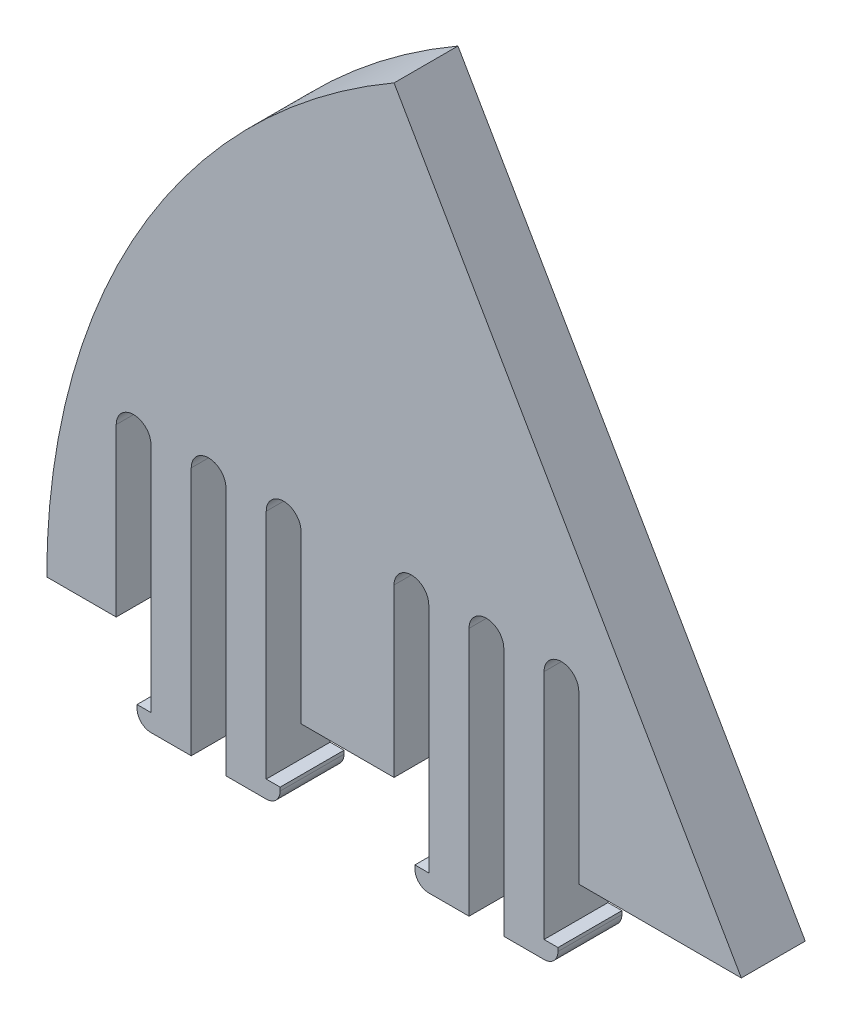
ISO-10303-21;
HEADER;
FILE_DESCRIPTION(('STEP AP214'),'2;1');
FILE_NAME('part.step','',(''),(''),'','','');
FILE_SCHEMA(('AUTOMOTIVE_DESIGN { 1 0 10303 214 1 1 1 1 }'));
ENDSEC;
DATA;
#1=APPLICATION_CONTEXT('core data for automotive mechanical design processes');
#2=APPLICATION_PROTOCOL_DEFINITION('international standard','automotive_design',2000,#1);
#3=PRODUCT_CONTEXT('',#1,'mechanical');
#4=PRODUCT('Part','Part','',(#3));
#5=PRODUCT_RELATED_PRODUCT_CATEGORY('part','',(#4));
#6=PRODUCT_DEFINITION_FORMATION('','',#4);
#7=PRODUCT_DEFINITION_CONTEXT('part definition',#1,'design');
#8=PRODUCT_DEFINITION('design','',#6,#7);
#9=PRODUCT_DEFINITION_SHAPE('','',#8);
#10=(LENGTH_UNIT() NAMED_UNIT(*) SI_UNIT(.MILLI.,.METRE.));
#11=(NAMED_UNIT(*) PLANE_ANGLE_UNIT() SI_UNIT($,.RADIAN.));
#12=(NAMED_UNIT(*) SI_UNIT($,.STERADIAN.) SOLID_ANGLE_UNIT());
#13=UNCERTAINTY_MEASURE_WITH_UNIT(LENGTH_MEASURE(1.E-05),#10,'distance_accuracy_value','');
#14=(GEOMETRIC_REPRESENTATION_CONTEXT(3) GLOBAL_UNCERTAINTY_ASSIGNED_CONTEXT((#13)) GLOBAL_UNIT_ASSIGNED_CONTEXT((#10,
#11,#12)) REPRESENTATION_CONTEXT('',''));
#15=CARTESIAN_POINT('',(0.,0.,0.));
#16=DIRECTION('',(0.,0.,1.));
#17=DIRECTION('',(1.,0.,0.));
#18=AXIS2_PLACEMENT_3D('',#15,#16,#17);
#19=CARTESIAN_POINT('',(0.,0.,5.842));
#20=DIRECTION('',(-0.86602540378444,-0.499999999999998,0.));
#21=DIRECTION('',(0.499999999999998,-0.86602540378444,0.));
#22=AXIS2_PLACEMENT_3D('',#19,#20,#21);
#23=PLANE('',#22);
#24=DIRECTION('',(-0.499999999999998,0.86602540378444,0.));
#25=VECTOR('',#24,1.);
#26=CARTESIAN_POINT('',(0.,0.,0.));
#27=LINE('',#26,#25);
#28=CARTESIAN_POINT('',(0.,0.,0.));
#29=VERTEX_POINT('',#28);
#30=CARTESIAN_POINT('',(-31.7499999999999,54.9926131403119,0.));
#31=VERTEX_POINT('',#30);
#32=EDGE_CURVE('E617',#29,#31,#27,.T.);
#33=ORIENTED_EDGE('',*,*,#32,.T.);
#34=DIRECTION('',(0.,0.,-1.));
#35=VECTOR('',#34,1.);
#36=CARTESIAN_POINT('',(-31.7499999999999,54.9926131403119,5.842));
#37=LINE('',#36,#35);
#38=CARTESIAN_POINT('',(-31.7499999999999,54.9926131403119,5.842));
#39=VERTEX_POINT('',#38);
#40=EDGE_CURVE('E12',#39,#31,#37,.T.);
#41=ORIENTED_EDGE('',*,*,#40,.F.);
#42=DIRECTION('',(-0.499999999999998,0.86602540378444,0.));
#43=VECTOR('',#42,1.);
#44=CARTESIAN_POINT('',(0.,0.,5.842));
#45=LINE('',#44,#43);
#46=CARTESIAN_POINT('',(0.,0.,5.842));
#47=VERTEX_POINT('',#46);
#48=EDGE_CURVE('E489',#47,#39,#45,.T.);
#49=ORIENTED_EDGE('',*,*,#48,.F.);
#50=DIRECTION('',(0.,0.,-1.));
#51=VECTOR('',#50,1.);
#52=CARTESIAN_POINT('',(0.,0.,5.842));
#53=LINE('',#52,#51);
#54=EDGE_CURVE('E317',#47,#29,#53,.T.);
#55=ORIENTED_EDGE('',*,*,#54,.T.);
#56=EDGE_LOOP('',(#33,#41,#49,#55));
#57=FACE_BOUND('',#56,.T.);
#58=ADVANCED_FACE('F36',(#57),#23,.F.);
#59=CARTESIAN_POINT('',(0.,0.,5.842));
#60=DIRECTION('',(0.,0.,-1.));
#61=DIRECTION('',(-1.,0.,0.));
#62=AXIS2_PLACEMENT_3D('',#59,#60,#61);
#63=CYLINDRICAL_SURFACE('',#62,63.5);
#64=CARTESIAN_POINT('',(0.,0.,0.));
#65=DIRECTION('',(0.,0.,1.));
#66=DIRECTION('',(1.,0.,0.));
#67=AXIS2_PLACEMENT_3D('',#64,#65,#66);
#68=CIRCLE('',#67,63.5);
#69=CARTESIAN_POINT('',(-63.5,0.,0.));
#70=VERTEX_POINT('',#69);
#71=EDGE_CURVE('E611',#31,#70,#68,.T.);
#72=ORIENTED_EDGE('',*,*,#71,.T.);
#73=DIRECTION('',(0.,0.,-1.));
#74=VECTOR('',#73,1.);
#75=CARTESIAN_POINT('',(-63.5,0.,5.842));
#76=LINE('',#75,#74);
#77=CARTESIAN_POINT('',(-63.5,0.,5.842));
#78=VERTEX_POINT('',#77);
#79=EDGE_CURVE('E44',#78,#70,#76,.T.);
#80=ORIENTED_EDGE('',*,*,#79,.F.);
#81=CARTESIAN_POINT('',(0.,0.,5.842));
#82=DIRECTION('',(0.,0.,1.));
#83=DIRECTION('',(1.,0.,0.));
#84=AXIS2_PLACEMENT_3D('',#81,#82,#83);
#85=CIRCLE('',#84,63.5);
#86=EDGE_CURVE('E188',#39,#78,#85,.T.);
#87=ORIENTED_EDGE('',*,*,#86,.F.);
#88=ORIENTED_EDGE('',*,*,#40,.T.);
#89=EDGE_LOOP('',(#72,#80,#87,#88));
#90=FACE_BOUND('',#89,.T.);
#91=ADVANCED_FACE('F700',(#90),#63,.T.);
#92=CARTESIAN_POINT('',(-57.15,0.,5.842));
#93=DIRECTION('',(0.,1.,0.));
#94=DIRECTION('',(-1.,0.,0.));
#95=AXIS2_PLACEMENT_3D('',#92,#93,#94);
#96=PLANE('',#95);
#97=DIRECTION('',(1.,0.,0.));
#98=VECTOR('',#97,1.);
#99=CARTESIAN_POINT('',(-57.15,0.,0.));
#100=LINE('',#99,#98);
#101=CARTESIAN_POINT('',(-57.15,0.,0.));
#102=VERTEX_POINT('',#101);
#103=EDGE_CURVE('E606',#70,#102,#100,.T.);
#104=ORIENTED_EDGE('',*,*,#103,.T.);
#105=DIRECTION('',(0.,0.,-1.));
#106=VECTOR('',#105,1.);
#107=CARTESIAN_POINT('',(-57.15,0.,5.842));
#108=LINE('',#107,#106);
#109=CARTESIAN_POINT('',(-57.15,0.,5.842));
#110=VERTEX_POINT('',#109);
#111=EDGE_CURVE('E598',#110,#102,#108,.T.);
#112=ORIENTED_EDGE('',*,*,#111,.F.);
#113=DIRECTION('',(1.,0.,0.));
#114=VECTOR('',#113,1.);
#115=CARTESIAN_POINT('',(-57.15,0.,5.842));
#116=LINE('',#115,#114);
#117=EDGE_CURVE('E482',#78,#110,#116,.T.);
#118=ORIENTED_EDGE('',*,*,#117,.F.);
#119=ORIENTED_EDGE('',*,*,#79,.T.);
#120=EDGE_LOOP('',(#104,#112,#118,#119));
#121=FACE_BOUND('',#120,.T.);
#122=ADVANCED_FACE('F604',(#121),#96,.F.);
#123=CARTESIAN_POINT('',(-57.15,0.,5.842));
#124=DIRECTION('',(-1.,0.,0.));
#125=DIRECTION('',(0.,0.,1.));
#126=AXIS2_PLACEMENT_3D('',#123,#124,#125);
#127=PLANE('',#126);
#128=DIRECTION('',(0.,1.,0.));
#129=VECTOR('',#128,1.);
#130=CARTESIAN_POINT('',(-57.15,0.,0.));
#131=LINE('',#130,#129);
#132=CARTESIAN_POINT('',(-57.15,15.24,0.));
#133=VERTEX_POINT('',#132);
#134=EDGE_CURVE('E613',#102,#133,#131,.T.);
#135=ORIENTED_EDGE('',*,*,#134,.T.);
#136=DIRECTION('',(0.,0.,-1.));
#137=VECTOR('',#136,1.);
#138=CARTESIAN_POINT('',(-57.15,15.24,5.842));
#139=LINE('',#138,#137);
#140=CARTESIAN_POINT('',(-57.15,15.24,5.842));
#141=VERTEX_POINT('',#140);
#142=EDGE_CURVE('E595',#141,#133,#139,.T.);
#143=ORIENTED_EDGE('',*,*,#142,.F.);
#144=DIRECTION('',(0.,1.,0.));
#145=VECTOR('',#144,1.);
#146=CARTESIAN_POINT('',(-57.15,0.,5.842));
#147=LINE('',#146,#145);
#148=EDGE_CURVE('E479',#110,#141,#147,.T.);
#149=ORIENTED_EDGE('',*,*,#148,.F.);
#150=ORIENTED_EDGE('',*,*,#111,.T.);
#151=EDGE_LOOP('',(#135,#143,#149,#150));
#152=FACE_BOUND('',#151,.T.);
#153=ADVANCED_FACE('F707',(#152),#127,.F.);
#154=CARTESIAN_POINT('',(-55.5625,15.24,5.842));
#155=DIRECTION('',(0.,0.,-1.));
#156=DIRECTION('',(-1.,0.,0.));
#157=AXIS2_PLACEMENT_3D('',#154,#155,#156);
#158=CYLINDRICAL_SURFACE('',#157,1.5875);
#159=CARTESIAN_POINT('',(-55.5625,15.24,0.));
#160=DIRECTION('',(0.,0.,-1.));
#161=DIRECTION('',(1.,0.,0.));
#162=AXIS2_PLACEMENT_3D('',#159,#160,#161);
#163=CIRCLE('',#162,1.5875);
#164=CARTESIAN_POINT('',(-53.975,15.24,0.));
#165=VERTEX_POINT('',#164);
#166=EDGE_CURVE('E615',#133,#165,#163,.T.);
#167=ORIENTED_EDGE('',*,*,#166,.T.);
#168=DIRECTION('',(0.,0.,-1.));
#169=VECTOR('',#168,1.);
#170=CARTESIAN_POINT('',(-53.975,15.24,5.842));
#171=LINE('',#170,#169);
#172=CARTESIAN_POINT('',(-53.975,15.24,5.842));
#173=VERTEX_POINT('',#172);
#174=EDGE_CURVE('E592',#173,#165,#171,.T.);
#175=ORIENTED_EDGE('',*,*,#174,.F.);
#176=CARTESIAN_POINT('',(-55.5625,15.24,5.842));
#177=DIRECTION('',(0.,0.,-1.));
#178=DIRECTION('',(1.,0.,0.));
#179=AXIS2_PLACEMENT_3D('',#176,#177,#178);
#180=CIRCLE('',#179,1.5875);
#181=EDGE_CURVE('E471',#141,#173,#180,.T.);
#182=ORIENTED_EDGE('',*,*,#181,.F.);
#183=ORIENTED_EDGE('',*,*,#142,.T.);
#184=EDGE_LOOP('',(#167,#175,#182,#183));
#185=FACE_BOUND('',#184,.T.);
#186=ADVANCED_FACE('F712',(#185),#158,.F.);
#187=CARTESIAN_POINT('',(-53.975,-5.96900000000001,5.842));
#188=DIRECTION('',(1.,0.,0.));
#189=DIRECTION('',(0.,1.,0.));
#190=AXIS2_PLACEMENT_3D('',#187,#188,#189);
#191=PLANE('',#190);
#192=DIRECTION('',(0.,-1.,0.));
#193=VECTOR('',#192,1.);
#194=CARTESIAN_POINT('',(-53.975,-5.96900000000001,0.));
#195=LINE('',#194,#193);
#196=CARTESIAN_POINT('',(-53.975,-5.96900000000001,0.));
#197=VERTEX_POINT('',#196);
#198=EDGE_CURVE('E621',#165,#197,#195,.T.);
#199=ORIENTED_EDGE('',*,*,#198,.T.);
#200=DIRECTION('',(0.,0.,-1.));
#201=VECTOR('',#200,1.);
#202=CARTESIAN_POINT('',(-53.975,-5.96900000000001,5.842));
#203=LINE('',#202,#201);
#204=CARTESIAN_POINT('',(-53.975,-5.96900000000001,5.842));
#205=VERTEX_POINT('',#204);
#206=EDGE_CURVE('E589',#205,#197,#203,.T.);
#207=ORIENTED_EDGE('',*,*,#206,.F.);
#208=DIRECTION('',(0.,-1.,0.));
#209=VECTOR('',#208,1.);
#210=CARTESIAN_POINT('',(-53.975,-5.96900000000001,5.842));
#211=LINE('',#210,#209);
#212=EDGE_CURVE('E467',#173,#205,#211,.T.);
#213=ORIENTED_EDGE('',*,*,#212,.F.);
#214=ORIENTED_EDGE('',*,*,#174,.T.);
#215=EDGE_LOOP('',(#199,#207,#213,#214));
#216=FACE_BOUND('',#215,.T.);
#217=ADVANCED_FACE('F716',(#216),#191,.F.);
#218=CARTESIAN_POINT('',(-55.245,-5.96900000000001,5.842));
#219=DIRECTION('',(0.,-1.,0.));
#220=DIRECTION('',(1.,0.,0.));
#221=AXIS2_PLACEMENT_3D('',#218,#219,#220);
#222=PLANE('',#221);
#223=DIRECTION('',(-1.,0.,0.));
#224=VECTOR('',#223,1.);
#225=CARTESIAN_POINT('',(-55.245,-5.96900000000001,0.));
#226=LINE('',#225,#224);
#227=CARTESIAN_POINT('',(-55.245,-5.96900000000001,0.));
#228=VERTEX_POINT('',#227);
#229=EDGE_CURVE('E623',#197,#228,#226,.T.);
#230=ORIENTED_EDGE('',*,*,#229,.T.);
#231=DIRECTION('',(0.,0.,-1.));
#232=VECTOR('',#231,1.);
#233=CARTESIAN_POINT('',(-55.245,-5.96900000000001,5.842));
#234=LINE('',#233,#232);
#235=CARTESIAN_POINT('',(-55.245,-5.96900000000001,5.842));
#236=VERTEX_POINT('',#235);
#237=EDGE_CURVE('E586',#236,#228,#234,.T.);
#238=ORIENTED_EDGE('',*,*,#237,.F.);
#239=DIRECTION('',(-1.,0.,0.));
#240=VECTOR('',#239,1.);
#241=CARTESIAN_POINT('',(-55.245,-5.96900000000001,5.842));
#242=LINE('',#241,#240);
#243=EDGE_CURVE('E463',#205,#236,#242,.T.);
#244=ORIENTED_EDGE('',*,*,#243,.F.);
#245=ORIENTED_EDGE('',*,*,#206,.T.);
#246=EDGE_LOOP('',(#230,#238,#244,#245));
#247=FACE_BOUND('',#246,.T.);
#248=ADVANCED_FACE('F720',(#247),#222,.F.);
#249=CARTESIAN_POINT('',(-55.245,-6.28650000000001,5.842));
#250=DIRECTION('',(1.,0.,0.));
#251=DIRECTION('',(0.,0.,-1.));
#252=AXIS2_PLACEMENT_3D('',#249,#250,#251);
#253=PLANE('',#252);
#254=DIRECTION('',(0.,-1.,0.));
#255=VECTOR('',#254,1.);
#256=CARTESIAN_POINT('',(-55.245,-6.28650000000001,0.));
#257=LINE('',#256,#255);
#258=CARTESIAN_POINT('',(-55.245,-6.28650000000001,0.));
#259=VERTEX_POINT('',#258);
#260=EDGE_CURVE('E625',#228,#259,#257,.T.);
#261=ORIENTED_EDGE('',*,*,#260,.T.);
#262=DIRECTION('',(0.,0.,-1.));
#263=VECTOR('',#262,1.);
#264=CARTESIAN_POINT('',(-55.245,-6.28650000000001,5.842));
#265=LINE('',#264,#263);
#266=CARTESIAN_POINT('',(-55.245,-6.28650000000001,5.842));
#267=VERTEX_POINT('',#266);
#268=EDGE_CURVE('E583',#267,#259,#265,.T.);
#269=ORIENTED_EDGE('',*,*,#268,.F.);
#270=DIRECTION('',(0.,-1.,0.));
#271=VECTOR('',#270,1.);
#272=CARTESIAN_POINT('',(-55.245,-6.28650000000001,5.842));
#273=LINE('',#272,#271);
#274=EDGE_CURVE('E460',#236,#267,#273,.T.);
#275=ORIENTED_EDGE('',*,*,#274,.F.);
#276=ORIENTED_EDGE('',*,*,#237,.T.);
#277=EDGE_LOOP('',(#261,#269,#275,#276));
#278=FACE_BOUND('',#277,.T.);
#279=ADVANCED_FACE('F724',(#278),#253,.F.);
#280=CARTESIAN_POINT('',(-53.975,-6.28650000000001,5.842));
#281=DIRECTION('',(0.,0.,-1.));
#282=DIRECTION('',(-1.,0.,0.));
#283=AXIS2_PLACEMENT_3D('',#280,#281,#282);
#284=CYLINDRICAL_SURFACE('',#283,1.27);
#285=CARTESIAN_POINT('',(-53.975,-6.28650000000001,0.));
#286=DIRECTION('',(0.,0.,1.));
#287=DIRECTION('',(1.,0.,0.));
#288=AXIS2_PLACEMENT_3D('',#285,#286,#287);
#289=CIRCLE('',#288,1.27);
#290=CARTESIAN_POINT('',(-53.975,-7.55650000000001,0.));
#291=VERTEX_POINT('',#290);
#292=EDGE_CURVE('E627',#259,#291,#289,.T.);
#293=ORIENTED_EDGE('',*,*,#292,.T.);
#294=DIRECTION('',(0.,0.,-1.));
#295=VECTOR('',#294,1.);
#296=CARTESIAN_POINT('',(-53.975,-7.55650000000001,5.842));
#297=LINE('',#296,#295);
#298=CARTESIAN_POINT('',(-53.975,-7.55650000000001,5.842));
#299=VERTEX_POINT('',#298);
#300=EDGE_CURVE('E580',#299,#291,#297,.T.);
#301=ORIENTED_EDGE('',*,*,#300,.F.);
#302=CARTESIAN_POINT('',(-53.975,-6.28650000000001,5.842));
#303=DIRECTION('',(0.,0.,1.));
#304=DIRECTION('',(1.,0.,0.));
#305=AXIS2_PLACEMENT_3D('',#302,#303,#304);
#306=CIRCLE('',#305,1.27);
#307=EDGE_CURVE('E452',#267,#299,#306,.T.);
#308=ORIENTED_EDGE('',*,*,#307,.F.);
#309=ORIENTED_EDGE('',*,*,#268,.T.);
#310=EDGE_LOOP('',(#293,#301,#308,#309));
#311=FACE_BOUND('',#310,.T.);
#312=ADVANCED_FACE('F728',(#311),#284,.T.);
#313=CARTESIAN_POINT('',(-50.292,-7.55650000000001,5.842));
#314=DIRECTION('',(0.,1.,0.));
#315=DIRECTION('',(0.,0.,1.));
#316=AXIS2_PLACEMENT_3D('',#313,#314,#315);
#317=PLANE('',#316);
#318=DIRECTION('',(1.,0.,0.));
#319=VECTOR('',#318,1.);
#320=CARTESIAN_POINT('',(-50.292,-7.55650000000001,0.));
#321=LINE('',#320,#319);
#322=CARTESIAN_POINT('',(-50.292,-7.55650000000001,0.));
#323=VERTEX_POINT('',#322);
#324=EDGE_CURVE('E629',#291,#323,#321,.T.);
#325=ORIENTED_EDGE('',*,*,#324,.T.);
#326=DIRECTION('',(0.,0.,-1.));
#327=VECTOR('',#326,1.);
#328=CARTESIAN_POINT('',(-50.292,-7.55650000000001,5.842));
#329=LINE('',#328,#327);
#330=CARTESIAN_POINT('',(-50.292,-7.55650000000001,5.842));
#331=VERTEX_POINT('',#330);
#332=EDGE_CURVE('E577',#331,#323,#329,.T.);
#333=ORIENTED_EDGE('',*,*,#332,.F.);
#334=DIRECTION('',(1.,0.,0.));
#335=VECTOR('',#334,1.);
#336=CARTESIAN_POINT('',(-50.292,-7.55650000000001,5.842));
#337=LINE('',#336,#335);
#338=EDGE_CURVE('E448',#299,#331,#337,.T.);
#339=ORIENTED_EDGE('',*,*,#338,.F.);
#340=ORIENTED_EDGE('',*,*,#300,.T.);
#341=EDGE_LOOP('',(#325,#333,#339,#340));
#342=FACE_BOUND('',#341,.T.);
#343=ADVANCED_FACE('F732',(#342),#317,.F.);
#344=CARTESIAN_POINT('',(-50.292,-7.55650000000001,5.842));
#345=DIRECTION('',(-1.,0.,0.));
#346=DIRECTION('',(0.,-1.,0.));
#347=AXIS2_PLACEMENT_3D('',#344,#345,#346);
#348=PLANE('',#347);
#349=DIRECTION('',(0.,1.,0.));
#350=VECTOR('',#349,1.);
#351=CARTESIAN_POINT('',(-50.292,-7.55650000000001,0.));
#352=LINE('',#351,#350);
#353=CARTESIAN_POINT('',(-50.292,15.24,0.));
#354=VERTEX_POINT('',#353);
#355=EDGE_CURVE('E631',#323,#354,#352,.T.);
#356=ORIENTED_EDGE('',*,*,#355,.T.);
#357=DIRECTION('',(0.,0.,-1.));
#358=VECTOR('',#357,1.);
#359=CARTESIAN_POINT('',(-50.292,15.24,5.842));
#360=LINE('',#359,#358);
#361=CARTESIAN_POINT('',(-50.292,15.24,5.842));
#362=VERTEX_POINT('',#361);
#363=EDGE_CURVE('E574',#362,#354,#360,.T.);
#364=ORIENTED_EDGE('',*,*,#363,.F.);
#365=DIRECTION('',(0.,1.,0.));
#366=VECTOR('',#365,1.);
#367=CARTESIAN_POINT('',(-50.292,-7.55650000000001,5.842));
#368=LINE('',#367,#366);
#369=EDGE_CURVE('E444',#331,#362,#368,.T.);
#370=ORIENTED_EDGE('',*,*,#369,.F.);
#371=ORIENTED_EDGE('',*,*,#332,.T.);
#372=EDGE_LOOP('',(#356,#364,#370,#371));
#373=FACE_BOUND('',#372,.T.);
#374=ADVANCED_FACE('F736',(#373),#348,.F.);
#375=CARTESIAN_POINT('',(-48.7045,15.24,5.842));
#376=DIRECTION('',(0.,0.,-1.));
#377=DIRECTION('',(-1.,0.,0.));
#378=AXIS2_PLACEMENT_3D('',#375,#376,#377);
#379=CYLINDRICAL_SURFACE('',#378,1.5875);
#380=CARTESIAN_POINT('',(-48.7045,15.24,0.));
#381=DIRECTION('',(0.,0.,-1.));
#382=DIRECTION('',(1.,0.,0.));
#383=AXIS2_PLACEMENT_3D('',#380,#381,#382);
#384=CIRCLE('',#383,1.5875);
#385=CARTESIAN_POINT('',(-47.117,15.24,0.));
#386=VERTEX_POINT('',#385);
#387=EDGE_CURVE('E633',#354,#386,#384,.T.);
#388=ORIENTED_EDGE('',*,*,#387,.T.);
#389=DIRECTION('',(0.,0.,-1.));
#390=VECTOR('',#389,1.);
#391=CARTESIAN_POINT('',(-47.117,15.24,5.842));
#392=LINE('',#391,#390);
#393=CARTESIAN_POINT('',(-47.117,15.24,5.842));
#394=VERTEX_POINT('',#393);
#395=EDGE_CURVE('E571',#394,#386,#392,.T.);
#396=ORIENTED_EDGE('',*,*,#395,.F.);
#397=CARTESIAN_POINT('',(-48.7045,15.24,5.842));
#398=DIRECTION('',(0.,0.,-1.));
#399=DIRECTION('',(1.,0.,0.));
#400=AXIS2_PLACEMENT_3D('',#397,#398,#399);
#401=CIRCLE('',#400,1.5875);
#402=EDGE_CURVE('E441',#362,#394,#401,.T.);
#403=ORIENTED_EDGE('',*,*,#402,.F.);
#404=ORIENTED_EDGE('',*,*,#363,.T.);
#405=EDGE_LOOP('',(#388,#396,#403,#404));
#406=FACE_BOUND('',#405,.T.);
#407=ADVANCED_FACE('F740',(#406),#379,.F.);
#408=CARTESIAN_POINT('',(-47.117,-7.55650000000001,5.842));
#409=DIRECTION('',(1.,0.,0.));
#410=DIRECTION('',(0.,1.,0.));
#411=AXIS2_PLACEMENT_3D('',#408,#409,#410);
#412=PLANE('',#411);
#413=DIRECTION('',(0.,-1.,0.));
#414=VECTOR('',#413,1.);
#415=CARTESIAN_POINT('',(-47.117,-7.55650000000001,0.));
#416=LINE('',#415,#414);
#417=CARTESIAN_POINT('',(-47.117,-7.55650000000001,0.));
#418=VERTEX_POINT('',#417);
#419=EDGE_CURVE('E635',#386,#418,#416,.T.);
#420=ORIENTED_EDGE('',*,*,#419,.T.);
#421=DIRECTION('',(0.,0.,-1.));
#422=VECTOR('',#421,1.);
#423=CARTESIAN_POINT('',(-47.117,-7.55650000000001,5.842));
#424=LINE('',#423,#422);
#425=CARTESIAN_POINT('',(-47.117,-7.55650000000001,5.842));
#426=VERTEX_POINT('',#425);
#427=EDGE_CURVE('E568',#426,#418,#424,.T.);
#428=ORIENTED_EDGE('',*,*,#427,.F.);
#429=DIRECTION('',(0.,-1.,0.));
#430=VECTOR('',#429,1.);
#431=CARTESIAN_POINT('',(-47.117,-7.55650000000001,5.842));
#432=LINE('',#431,#430);
#433=EDGE_CURVE('E433',#394,#426,#432,.T.);
#434=ORIENTED_EDGE('',*,*,#433,.F.);
#435=ORIENTED_EDGE('',*,*,#395,.T.);
#436=EDGE_LOOP('',(#420,#428,#434,#435));
#437=FACE_BOUND('',#436,.T.);
#438=ADVANCED_FACE('F744',(#437),#412,.F.);
#439=CARTESIAN_POINT('',(-47.117,-7.55650000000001,5.842));
#440=DIRECTION('',(0.,1.,0.));
#441=DIRECTION('',(-1.,0.,0.));
#442=AXIS2_PLACEMENT_3D('',#439,#440,#441);
#443=PLANE('',#442);
#444=DIRECTION('',(1.,0.,0.));
#445=VECTOR('',#444,1.);
#446=CARTESIAN_POINT('',(-47.117,-7.55650000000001,0.));
#447=LINE('',#446,#445);
#448=CARTESIAN_POINT('',(-43.434,-7.55650000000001,0.));
#449=VERTEX_POINT('',#448);
#450=EDGE_CURVE('E637',#418,#449,#447,.T.);
#451=ORIENTED_EDGE('',*,*,#450,.T.);
#452=DIRECTION('',(0.,0.,-1.));
#453=VECTOR('',#452,1.);
#454=CARTESIAN_POINT('',(-43.434,-7.55650000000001,5.842));
#455=LINE('',#454,#453);
#456=CARTESIAN_POINT('',(-43.434,-7.55650000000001,5.842));
#457=VERTEX_POINT('',#456);
#458=EDGE_CURVE('E565',#457,#449,#455,.T.);
#459=ORIENTED_EDGE('',*,*,#458,.F.);
#460=DIRECTION('',(1.,0.,0.));
#461=VECTOR('',#460,1.);
#462=CARTESIAN_POINT('',(-47.117,-7.55650000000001,5.842));
#463=LINE('',#462,#461);
#464=EDGE_CURVE('E429',#426,#457,#463,.T.);
#465=ORIENTED_EDGE('',*,*,#464,.F.);
#466=ORIENTED_EDGE('',*,*,#427,.T.);
#467=EDGE_LOOP('',(#451,#459,#465,#466));
#468=FACE_BOUND('',#467,.T.);
#469=ADVANCED_FACE('F748',(#468),#443,.F.);
#470=CARTESIAN_POINT('',(-43.434,-6.28650000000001,5.842));
#471=DIRECTION('',(0.,0.,-1.));
#472=DIRECTION('',(-1.,0.,0.));
#473=AXIS2_PLACEMENT_3D('',#470,#471,#472);
#474=CYLINDRICAL_SURFACE('',#473,1.27);
#475=CARTESIAN_POINT('',(-43.434,-6.28650000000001,0.));
#476=DIRECTION('',(0.,0.,1.));
#477=DIRECTION('',(-1.,0.,0.));
#478=AXIS2_PLACEMENT_3D('',#475,#476,#477);
#479=CIRCLE('',#478,1.27);
#480=CARTESIAN_POINT('',(-42.164,-6.2865,0.));
#481=VERTEX_POINT('',#480);
#482=EDGE_CURVE('E639',#449,#481,#479,.T.);
#483=ORIENTED_EDGE('',*,*,#482,.T.);
#484=DIRECTION('',(0.,0.,-1.));
#485=VECTOR('',#484,1.);
#486=CARTESIAN_POINT('',(-42.164,-6.2865,5.842));
#487=LINE('',#486,#485);
#488=CARTESIAN_POINT('',(-42.164,-6.2865,5.842));
#489=VERTEX_POINT('',#488);
#490=EDGE_CURVE('E562',#489,#481,#487,.T.);
#491=ORIENTED_EDGE('',*,*,#490,.F.);
#492=CARTESIAN_POINT('',(-43.434,-6.28650000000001,5.842));
#493=DIRECTION('',(0.,0.,1.));
#494=DIRECTION('',(-1.,0.,0.));
#495=AXIS2_PLACEMENT_3D('',#492,#493,#494);
#496=CIRCLE('',#495,1.27);
#497=EDGE_CURVE('E425',#457,#489,#496,.T.);
#498=ORIENTED_EDGE('',*,*,#497,.F.);
#499=ORIENTED_EDGE('',*,*,#458,.T.);
#500=EDGE_LOOP('',(#483,#491,#498,#499));
#501=FACE_BOUND('',#500,.T.);
#502=ADVANCED_FACE('F752',(#501),#474,.T.);
#503=CARTESIAN_POINT('',(-42.164,-6.2865,5.842));
#504=DIRECTION('',(-1.,0.,0.));
#505=DIRECTION('',(0.,0.,1.));
#506=AXIS2_PLACEMENT_3D('',#503,#504,#505);
#507=PLANE('',#506);
#508=DIRECTION('',(0.,1.,0.));
#509=VECTOR('',#508,1.);
#510=CARTESIAN_POINT('',(-42.164,-6.2865,0.));
#511=LINE('',#510,#509);
#512=CARTESIAN_POINT('',(-42.164,-5.969,0.));
#513=VERTEX_POINT('',#512);
#514=EDGE_CURVE('E641',#481,#513,#511,.T.);
#515=ORIENTED_EDGE('',*,*,#514,.T.);
#516=DIRECTION('',(0.,0.,-1.));
#517=VECTOR('',#516,1.);
#518=CARTESIAN_POINT('',(-42.164,-5.969,5.842));
#519=LINE('',#518,#517);
#520=CARTESIAN_POINT('',(-42.164,-5.969,5.842));
#521=VERTEX_POINT('',#520);
#522=EDGE_CURVE('E559',#521,#513,#519,.T.);
#523=ORIENTED_EDGE('',*,*,#522,.F.);
#524=DIRECTION('',(0.,1.,0.));
#525=VECTOR('',#524,1.);
#526=CARTESIAN_POINT('',(-42.164,-6.2865,5.842));
#527=LINE('',#526,#525);
#528=EDGE_CURVE('E422',#489,#521,#527,.T.);
#529=ORIENTED_EDGE('',*,*,#528,.F.);
#530=ORIENTED_EDGE('',*,*,#490,.T.);
#531=EDGE_LOOP('',(#515,#523,#529,#530));
#532=FACE_BOUND('',#531,.T.);
#533=ADVANCED_FACE('F756',(#532),#507,.F.);
#534=CARTESIAN_POINT('',(-42.164,-5.969,5.842));
#535=DIRECTION('',(0.,-1.,0.));
#536=DIRECTION('',(1.,0.,0.));
#537=AXIS2_PLACEMENT_3D('',#534,#535,#536);
#538=PLANE('',#537);
#539=DIRECTION('',(-1.,0.,0.));
#540=VECTOR('',#539,1.);
#541=CARTESIAN_POINT('',(-42.164,-5.969,0.));
#542=LINE('',#541,#540);
#543=CARTESIAN_POINT('',(-43.434,-5.969,0.));
#544=VERTEX_POINT('',#543);
#545=EDGE_CURVE('E643',#513,#544,#542,.T.);
#546=ORIENTED_EDGE('',*,*,#545,.T.);
#547=DIRECTION('',(0.,0.,-1.));
#548=VECTOR('',#547,1.);
#549=CARTESIAN_POINT('',(-43.434,-5.969,5.842));
#550=LINE('',#549,#548);
#551=CARTESIAN_POINT('',(-43.434,-5.969,5.842));
#552=VERTEX_POINT('',#551);
#553=EDGE_CURVE('E556',#552,#544,#550,.T.);
#554=ORIENTED_EDGE('',*,*,#553,.F.);
#555=DIRECTION('',(-1.,0.,0.));
#556=VECTOR('',#555,1.);
#557=CARTESIAN_POINT('',(-42.164,-5.969,5.842));
#558=LINE('',#557,#556);
#559=EDGE_CURVE('E414',#521,#552,#558,.T.);
#560=ORIENTED_EDGE('',*,*,#559,.F.);
#561=ORIENTED_EDGE('',*,*,#522,.T.);
#562=EDGE_LOOP('',(#546,#554,#560,#561));
#563=FACE_BOUND('',#562,.T.);
#564=ADVANCED_FACE('F760',(#563),#538,.F.);
#565=CARTESIAN_POINT('',(-43.434,-5.969,5.842));
#566=DIRECTION('',(-1.,0.,0.));
#567=DIRECTION('',(0.,-1.,0.));
#568=AXIS2_PLACEMENT_3D('',#565,#566,#567);
#569=PLANE('',#568);
#570=DIRECTION('',(0.,1.,0.));
#571=VECTOR('',#570,1.);
#572=CARTESIAN_POINT('',(-43.434,-5.969,0.));
#573=LINE('',#572,#571);
#574=CARTESIAN_POINT('',(-43.434,15.24,0.));
#575=VERTEX_POINT('',#574);
#576=EDGE_CURVE('E645',#544,#575,#573,.T.);
#577=ORIENTED_EDGE('',*,*,#576,.T.);
#578=DIRECTION('',(0.,0.,-1.));
#579=VECTOR('',#578,1.);
#580=CARTESIAN_POINT('',(-43.434,15.24,5.842));
#581=LINE('',#580,#579);
#582=CARTESIAN_POINT('',(-43.434,15.24,5.842));
#583=VERTEX_POINT('',#582);
#584=EDGE_CURVE('E553',#583,#575,#581,.T.);
#585=ORIENTED_EDGE('',*,*,#584,.F.);
#586=DIRECTION('',(0.,1.,0.));
#587=VECTOR('',#586,1.);
#588=CARTESIAN_POINT('',(-43.434,-5.969,5.842));
#589=LINE('',#588,#587);
#590=EDGE_CURVE('E410',#552,#583,#589,.T.);
#591=ORIENTED_EDGE('',*,*,#590,.F.);
#592=ORIENTED_EDGE('',*,*,#553,.T.);
#593=EDGE_LOOP('',(#577,#585,#591,#592));
#594=FACE_BOUND('',#593,.T.);
#595=ADVANCED_FACE('F764',(#594),#569,.F.);
#596=CARTESIAN_POINT('',(-41.8465,15.24,5.842));
#597=DIRECTION('',(0.,0.,-1.));
#598=DIRECTION('',(-1.,0.,0.));
#599=AXIS2_PLACEMENT_3D('',#596,#597,#598);
#600=CYLINDRICAL_SURFACE('',#599,1.5875);
#601=CARTESIAN_POINT('',(-41.8465,15.24,0.));
#602=DIRECTION('',(0.,0.,-1.));
#603=DIRECTION('',(1.,0.,0.));
#604=AXIS2_PLACEMENT_3D('',#601,#602,#603);
#605=CIRCLE('',#604,1.5875);
#606=CARTESIAN_POINT('',(-40.259,15.24,0.));
#607=VERTEX_POINT('',#606);
#608=EDGE_CURVE('E647',#575,#607,#605,.T.);
#609=ORIENTED_EDGE('',*,*,#608,.T.);
#610=DIRECTION('',(0.,0.,-1.));
#611=VECTOR('',#610,1.);
#612=CARTESIAN_POINT('',(-40.259,15.24,5.842));
#613=LINE('',#612,#611);
#614=CARTESIAN_POINT('',(-40.259,15.24,5.842));
#615=VERTEX_POINT('',#614);
#616=EDGE_CURVE('E550',#615,#607,#613,.T.);
#617=ORIENTED_EDGE('',*,*,#616,.F.);
#618=CARTESIAN_POINT('',(-41.8465,15.24,5.842));
#619=DIRECTION('',(0.,0.,-1.));
#620=DIRECTION('',(1.,0.,0.));
#621=AXIS2_PLACEMENT_3D('',#618,#619,#620);
#622=CIRCLE('',#621,1.5875);
#623=EDGE_CURVE('E406',#583,#615,#622,.T.);
#624=ORIENTED_EDGE('',*,*,#623,.F.);
#625=ORIENTED_EDGE('',*,*,#584,.T.);
#626=EDGE_LOOP('',(#609,#617,#624,#625));
#627=FACE_BOUND('',#626,.T.);
#628=ADVANCED_FACE('F768',(#627),#600,.F.);
#629=CARTESIAN_POINT('',(-40.259,0.,5.842));
#630=DIRECTION('',(1.,0.,0.));
#631=DIRECTION('',(0.,1.,0.));
#632=AXIS2_PLACEMENT_3D('',#629,#630,#631);
#633=PLANE('',#632);
#634=DIRECTION('',(0.,-1.,0.));
#635=VECTOR('',#634,1.);
#636=CARTESIAN_POINT('',(-40.259,0.,0.));
#637=LINE('',#636,#635);
#638=CARTESIAN_POINT('',(-40.259,0.,0.));
#639=VERTEX_POINT('',#638);
#640=EDGE_CURVE('E649',#607,#639,#637,.T.);
#641=ORIENTED_EDGE('',*,*,#640,.T.);
#642=DIRECTION('',(0.,0.,-1.));
#643=VECTOR('',#642,1.);
#644=CARTESIAN_POINT('',(-40.259,0.,5.842));
#645=LINE('',#644,#643);
#646=CARTESIAN_POINT('',(-40.259,0.,5.842));
#647=VERTEX_POINT('',#646);
#648=EDGE_CURVE('E547',#647,#639,#645,.T.);
#649=ORIENTED_EDGE('',*,*,#648,.F.);
#650=DIRECTION('',(0.,-1.,0.));
#651=VECTOR('',#650,1.);
#652=CARTESIAN_POINT('',(-40.259,0.,5.842));
#653=LINE('',#652,#651);
#654=EDGE_CURVE('E403',#615,#647,#653,.T.);
#655=ORIENTED_EDGE('',*,*,#654,.F.);
#656=ORIENTED_EDGE('',*,*,#616,.T.);
#657=EDGE_LOOP('',(#641,#649,#655,#656));
#658=FACE_BOUND('',#657,.T.);
#659=ADVANCED_FACE('F772',(#658),#633,.F.);
#660=CARTESIAN_POINT('',(-31.75,0.,5.842));
#661=DIRECTION('',(0.,1.,0.));
#662=DIRECTION('',(-1.,0.,0.));
#663=AXIS2_PLACEMENT_3D('',#660,#661,#662);
#664=PLANE('',#663);
#665=DIRECTION('',(1.,0.,0.));
#666=VECTOR('',#665,1.);
#667=CARTESIAN_POINT('',(-31.75,0.,0.));
#668=LINE('',#667,#666);
#669=CARTESIAN_POINT('',(-31.75,0.,0.));
#670=VERTEX_POINT('',#669);
#671=EDGE_CURVE('E651',#639,#670,#668,.T.);
#672=ORIENTED_EDGE('',*,*,#671,.T.);
#673=DIRECTION('',(0.,0.,-1.));
#674=VECTOR('',#673,1.);
#675=CARTESIAN_POINT('',(-31.75,0.,5.842));
#676=LINE('',#675,#674);
#677=CARTESIAN_POINT('',(-31.75,0.,5.842));
#678=VERTEX_POINT('',#677);
#679=EDGE_CURVE('E544',#678,#670,#676,.T.);
#680=ORIENTED_EDGE('',*,*,#679,.F.);
#681=DIRECTION('',(1.,0.,0.));
#682=VECTOR('',#681,1.);
#683=CARTESIAN_POINT('',(-31.75,0.,5.842));
#684=LINE('',#683,#682);
#685=EDGE_CURVE('E395',#647,#678,#684,.T.);
#686=ORIENTED_EDGE('',*,*,#685,.F.);
#687=ORIENTED_EDGE('',*,*,#648,.T.);
#688=EDGE_LOOP('',(#672,#680,#686,#687));
#689=FACE_BOUND('',#688,.T.);
#690=ADVANCED_FACE('F776',(#689),#664,.F.);
#691=CARTESIAN_POINT('',(-31.75,0.,5.842));
#692=DIRECTION('',(-1.,0.,0.));
#693=DIRECTION('',(0.,0.,1.));
#694=AXIS2_PLACEMENT_3D('',#691,#692,#693);
#695=PLANE('',#694);
#696=DIRECTION('',(0.,1.,0.));
#697=VECTOR('',#696,1.);
#698=CARTESIAN_POINT('',(-31.75,0.,0.));
#699=LINE('',#698,#697);
#700=CARTESIAN_POINT('',(-31.75,15.24,0.));
#701=VERTEX_POINT('',#700);
#702=EDGE_CURVE('E653',#670,#701,#699,.T.);
#703=ORIENTED_EDGE('',*,*,#702,.T.);
#704=DIRECTION('',(0.,0.,-1.));
#705=VECTOR('',#704,1.);
#706=CARTESIAN_POINT('',(-31.75,15.24,5.842));
#707=LINE('',#706,#705);
#708=CARTESIAN_POINT('',(-31.75,15.24,5.842));
#709=VERTEX_POINT('',#708);
#710=EDGE_CURVE('E541',#709,#701,#707,.T.);
#711=ORIENTED_EDGE('',*,*,#710,.F.);
#712=DIRECTION('',(0.,1.,0.));
#713=VECTOR('',#712,1.);
#714=CARTESIAN_POINT('',(-31.75,0.,5.842));
#715=LINE('',#714,#713);
#716=EDGE_CURVE('E391',#678,#709,#715,.T.);
#717=ORIENTED_EDGE('',*,*,#716,.F.);
#718=ORIENTED_EDGE('',*,*,#679,.T.);
#719=EDGE_LOOP('',(#703,#711,#717,#718));
#720=FACE_BOUND('',#719,.T.);
#721=ADVANCED_FACE('F780',(#720),#695,.F.);
#722=CARTESIAN_POINT('',(-30.1625,15.24,5.842));
#723=DIRECTION('',(0.,0.,-1.));
#724=DIRECTION('',(-1.,0.,0.));
#725=AXIS2_PLACEMENT_3D('',#722,#723,#724);
#726=CYLINDRICAL_SURFACE('',#725,1.5875);
#727=CARTESIAN_POINT('',(-30.1625,15.24,0.));
#728=DIRECTION('',(0.,0.,-1.));
#729=DIRECTION('',(1.,0.,0.));
#730=AXIS2_PLACEMENT_3D('',#727,#728,#729);
#731=CIRCLE('',#730,1.5875);
#732=CARTESIAN_POINT('',(-28.575,15.24,0.));
#733=VERTEX_POINT('',#732);
#734=EDGE_CURVE('E655',#701,#733,#731,.T.);
#735=ORIENTED_EDGE('',*,*,#734,.T.);
#736=DIRECTION('',(0.,0.,-1.));
#737=VECTOR('',#736,1.);
#738=CARTESIAN_POINT('',(-28.575,15.24,5.842));
#739=LINE('',#738,#737);
#740=CARTESIAN_POINT('',(-28.575,15.24,5.842));
#741=VERTEX_POINT('',#740);
#742=EDGE_CURVE('E538',#741,#733,#739,.T.);
#743=ORIENTED_EDGE('',*,*,#742,.F.);
#744=CARTESIAN_POINT('',(-30.1625,15.24,5.842));
#745=DIRECTION('',(0.,0.,-1.));
#746=DIRECTION('',(1.,0.,0.));
#747=AXIS2_PLACEMENT_3D('',#744,#745,#746);
#748=CIRCLE('',#747,1.5875);
#749=EDGE_CURVE('E387',#709,#741,#748,.T.);
#750=ORIENTED_EDGE('',*,*,#749,.F.);
#751=ORIENTED_EDGE('',*,*,#710,.T.);
#752=EDGE_LOOP('',(#735,#743,#750,#751));
#753=FACE_BOUND('',#752,.T.);
#754=ADVANCED_FACE('F784',(#753),#726,.F.);
#755=CARTESIAN_POINT('',(-28.575,-5.969,5.842));
#756=DIRECTION('',(1.,0.,0.));
#757=DIRECTION('',(0.,1.,0.));
#758=AXIS2_PLACEMENT_3D('',#755,#756,#757);
#759=PLANE('',#758);
#760=DIRECTION('',(0.,-1.,0.));
#761=VECTOR('',#760,1.);
#762=CARTESIAN_POINT('',(-28.575,-5.969,0.));
#763=LINE('',#762,#761);
#764=CARTESIAN_POINT('',(-28.575,-5.969,0.));
#765=VERTEX_POINT('',#764);
#766=EDGE_CURVE('E657',#733,#765,#763,.T.);
#767=ORIENTED_EDGE('',*,*,#766,.T.);
#768=DIRECTION('',(0.,0.,-1.));
#769=VECTOR('',#768,1.);
#770=CARTESIAN_POINT('',(-28.575,-5.969,5.842));
#771=LINE('',#770,#769);
#772=CARTESIAN_POINT('',(-28.575,-5.969,5.842));
#773=VERTEX_POINT('',#772);
#774=EDGE_CURVE('E535',#773,#765,#771,.T.);
#775=ORIENTED_EDGE('',*,*,#774,.F.);
#776=DIRECTION('',(0.,-1.,0.));
#777=VECTOR('',#776,1.);
#778=CARTESIAN_POINT('',(-28.575,-5.969,5.842));
#779=LINE('',#778,#777);
#780=EDGE_CURVE('E384',#741,#773,#779,.T.);
#781=ORIENTED_EDGE('',*,*,#780,.F.);
#782=ORIENTED_EDGE('',*,*,#742,.T.);
#783=EDGE_LOOP('',(#767,#775,#781,#782));
#784=FACE_BOUND('',#783,.T.);
#785=ADVANCED_FACE('F788',(#784),#759,.F.);
#786=CARTESIAN_POINT('',(-29.845,-5.969,5.842));
#787=DIRECTION('',(0.,-1.,0.));
#788=DIRECTION('',(1.,0.,0.));
#789=AXIS2_PLACEMENT_3D('',#786,#787,#788);
#790=PLANE('',#789);
#791=DIRECTION('',(-1.,0.,0.));
#792=VECTOR('',#791,1.);
#793=CARTESIAN_POINT('',(-29.845,-5.969,0.));
#794=LINE('',#793,#792);
#795=CARTESIAN_POINT('',(-29.845,-5.969,0.));
#796=VERTEX_POINT('',#795);
#797=EDGE_CURVE('E659',#765,#796,#794,.T.);
#798=ORIENTED_EDGE('',*,*,#797,.T.);
#799=DIRECTION('',(0.,0.,-1.));
#800=VECTOR('',#799,1.);
#801=CARTESIAN_POINT('',(-29.845,-5.969,5.842));
#802=LINE('',#801,#800);
#803=CARTESIAN_POINT('',(-29.845,-5.969,5.842));
#804=VERTEX_POINT('',#803);
#805=EDGE_CURVE('E532',#804,#796,#802,.T.);
#806=ORIENTED_EDGE('',*,*,#805,.F.);
#807=DIRECTION('',(-1.,0.,0.));
#808=VECTOR('',#807,1.);
#809=CARTESIAN_POINT('',(-29.845,-5.969,5.842));
#810=LINE('',#809,#808);
#811=EDGE_CURVE('E376',#773,#804,#810,.T.);
#812=ORIENTED_EDGE('',*,*,#811,.F.);
#813=ORIENTED_EDGE('',*,*,#774,.T.);
#814=EDGE_LOOP('',(#798,#806,#812,#813));
#815=FACE_BOUND('',#814,.T.);
#816=ADVANCED_FACE('F792',(#815),#790,.F.);
#817=CARTESIAN_POINT('',(-29.845,-6.2865,5.842));
#818=DIRECTION('',(1.,0.,0.));
#819=DIRECTION('',(0.,0.,-1.));
#820=AXIS2_PLACEMENT_3D('',#817,#818,#819);
#821=PLANE('',#820);
#822=DIRECTION('',(0.,-1.,0.));
#823=VECTOR('',#822,1.);
#824=CARTESIAN_POINT('',(-29.845,-6.2865,0.));
#825=LINE('',#824,#823);
#826=CARTESIAN_POINT('',(-29.845,-6.2865,0.));
#827=VERTEX_POINT('',#826);
#828=EDGE_CURVE('E661',#796,#827,#825,.T.);
#829=ORIENTED_EDGE('',*,*,#828,.T.);
#830=DIRECTION('',(0.,0.,-1.));
#831=VECTOR('',#830,1.);
#832=CARTESIAN_POINT('',(-29.845,-6.2865,5.842));
#833=LINE('',#832,#831);
#834=CARTESIAN_POINT('',(-29.845,-6.2865,5.842));
#835=VERTEX_POINT('',#834);
#836=EDGE_CURVE('E529',#835,#827,#833,.T.);
#837=ORIENTED_EDGE('',*,*,#836,.F.);
#838=DIRECTION('',(0.,-1.,0.));
#839=VECTOR('',#838,1.);
#840=CARTESIAN_POINT('',(-29.845,-6.2865,5.842));
#841=LINE('',#840,#839);
#842=EDGE_CURVE('E372',#804,#835,#841,.T.);
#843=ORIENTED_EDGE('',*,*,#842,.F.);
#844=ORIENTED_EDGE('',*,*,#805,.T.);
#845=EDGE_LOOP('',(#829,#837,#843,#844));
#846=FACE_BOUND('',#845,.T.);
#847=ADVANCED_FACE('F796',(#846),#821,.F.);
#848=CARTESIAN_POINT('',(-28.575,-6.2865,5.842));
#849=DIRECTION('',(0.,0.,-1.));
#850=DIRECTION('',(-1.,0.,0.));
#851=AXIS2_PLACEMENT_3D('',#848,#849,#850);
#852=CYLINDRICAL_SURFACE('',#851,1.27);
#853=CARTESIAN_POINT('',(-28.575,-6.2865,0.));
#854=DIRECTION('',(0.,0.,1.));
#855=DIRECTION('',(1.,0.,0.));
#856=AXIS2_PLACEMENT_3D('',#853,#854,#855);
#857=CIRCLE('',#856,1.27);
#858=CARTESIAN_POINT('',(-28.575,-7.5565,0.));
#859=VERTEX_POINT('',#858);
#860=EDGE_CURVE('E663',#827,#859,#857,.T.);
#861=ORIENTED_EDGE('',*,*,#860,.T.);
#862=DIRECTION('',(0.,0.,-1.));
#863=VECTOR('',#862,1.);
#864=CARTESIAN_POINT('',(-28.575,-7.5565,5.842));
#865=LINE('',#864,#863);
#866=CARTESIAN_POINT('',(-28.575,-7.5565,5.842));
#867=VERTEX_POINT('',#866);
#868=EDGE_CURVE('E526',#867,#859,#865,.T.);
#869=ORIENTED_EDGE('',*,*,#868,.F.);
#870=CARTESIAN_POINT('',(-28.575,-6.2865,5.842));
#871=DIRECTION('',(0.,0.,1.));
#872=DIRECTION('',(1.,0.,0.));
#873=AXIS2_PLACEMENT_3D('',#870,#871,#872);
#874=CIRCLE('',#873,1.27);
#875=EDGE_CURVE('E368',#835,#867,#874,.T.);
#876=ORIENTED_EDGE('',*,*,#875,.F.);
#877=ORIENTED_EDGE('',*,*,#836,.T.);
#878=EDGE_LOOP('',(#861,#869,#876,#877));
#879=FACE_BOUND('',#878,.T.);
#880=ADVANCED_FACE('F800',(#879),#852,.T.);
#881=CARTESIAN_POINT('',(-24.892,-7.5565,5.842));
#882=DIRECTION('',(0.,1.,0.));
#883=DIRECTION('',(0.,0.,1.));
#884=AXIS2_PLACEMENT_3D('',#881,#882,#883);
#885=PLANE('',#884);
#886=DIRECTION('',(1.,0.,0.));
#887=VECTOR('',#886,1.);
#888=CARTESIAN_POINT('',(-24.892,-7.5565,0.));
#889=LINE('',#888,#887);
#890=CARTESIAN_POINT('',(-24.892,-7.5565,0.));
#891=VERTEX_POINT('',#890);
#892=EDGE_CURVE('E665',#859,#891,#889,.T.);
#893=ORIENTED_EDGE('',*,*,#892,.T.);
#894=DIRECTION('',(0.,0.,-1.));
#895=VECTOR('',#894,1.);
#896=CARTESIAN_POINT('',(-24.892,-7.5565,5.842));
#897=LINE('',#896,#895);
#898=CARTESIAN_POINT('',(-24.892,-7.5565,5.842));
#899=VERTEX_POINT('',#898);
#900=EDGE_CURVE('E523',#899,#891,#897,.T.);
#901=ORIENTED_EDGE('',*,*,#900,.F.);
#902=DIRECTION('',(1.,0.,0.));
#903=VECTOR('',#902,1.);
#904=CARTESIAN_POINT('',(-24.892,-7.5565,5.842));
#905=LINE('',#904,#903);
#906=EDGE_CURVE('E365',#867,#899,#905,.T.);
#907=ORIENTED_EDGE('',*,*,#906,.F.);
#908=ORIENTED_EDGE('',*,*,#868,.T.);
#909=EDGE_LOOP('',(#893,#901,#907,#908));
#910=FACE_BOUND('',#909,.T.);
#911=ADVANCED_FACE('F804',(#910),#885,.F.);
#912=CARTESIAN_POINT('',(-24.892,-7.5565,5.842));
#913=DIRECTION('',(-1.,0.,0.));
#914=DIRECTION('',(0.,-1.,0.));
#915=AXIS2_PLACEMENT_3D('',#912,#913,#914);
#916=PLANE('',#915);
#917=DIRECTION('',(0.,1.,0.));
#918=VECTOR('',#917,1.);
#919=CARTESIAN_POINT('',(-24.892,-7.5565,0.));
#920=LINE('',#919,#918);
#921=CARTESIAN_POINT('',(-24.892,15.24,0.));
#922=VERTEX_POINT('',#921);
#923=EDGE_CURVE('E667',#891,#922,#920,.T.);
#924=ORIENTED_EDGE('',*,*,#923,.T.);
#925=DIRECTION('',(0.,0.,-1.));
#926=VECTOR('',#925,1.);
#927=CARTESIAN_POINT('',(-24.892,15.24,5.842));
#928=LINE('',#927,#926);
#929=CARTESIAN_POINT('',(-24.892,15.24,5.842));
#930=VERTEX_POINT('',#929);
#931=EDGE_CURVE('E520',#930,#922,#928,.T.);
#932=ORIENTED_EDGE('',*,*,#931,.F.);
#933=DIRECTION('',(0.,1.,0.));
#934=VECTOR('',#933,1.);
#935=CARTESIAN_POINT('',(-24.892,-7.5565,5.842));
#936=LINE('',#935,#934);
#937=EDGE_CURVE('E357',#899,#930,#936,.T.);
#938=ORIENTED_EDGE('',*,*,#937,.F.);
#939=ORIENTED_EDGE('',*,*,#900,.T.);
#940=EDGE_LOOP('',(#924,#932,#938,#939));
#941=FACE_BOUND('',#940,.T.);
#942=ADVANCED_FACE('F808',(#941),#916,.F.);
#943=CARTESIAN_POINT('',(-23.3045,15.24,5.842));
#944=DIRECTION('',(0.,0.,-1.));
#945=DIRECTION('',(-1.,0.,0.));
#946=AXIS2_PLACEMENT_3D('',#943,#944,#945);
#947=CYLINDRICAL_SURFACE('',#946,1.5875);
#948=CARTESIAN_POINT('',(-23.3045,15.24,0.));
#949=DIRECTION('',(0.,0.,-1.));
#950=DIRECTION('',(1.,0.,0.));
#951=AXIS2_PLACEMENT_3D('',#948,#949,#950);
#952=CIRCLE('',#951,1.5875);
#953=CARTESIAN_POINT('',(-21.717,15.24,0.));
#954=VERTEX_POINT('',#953);
#955=EDGE_CURVE('E669',#922,#954,#952,.T.);
#956=ORIENTED_EDGE('',*,*,#955,.T.);
#957=DIRECTION('',(0.,0.,-1.));
#958=VECTOR('',#957,1.);
#959=CARTESIAN_POINT('',(-21.717,15.24,5.842));
#960=LINE('',#959,#958);
#961=CARTESIAN_POINT('',(-21.717,15.24,5.842));
#962=VERTEX_POINT('',#961);
#963=EDGE_CURVE('E517',#962,#954,#960,.T.);
#964=ORIENTED_EDGE('',*,*,#963,.F.);
#965=CARTESIAN_POINT('',(-23.3045,15.24,5.842));
#966=DIRECTION('',(0.,0.,-1.));
#967=DIRECTION('',(1.,0.,0.));
#968=AXIS2_PLACEMENT_3D('',#965,#966,#967);
#969=CIRCLE('',#968,1.5875);
#970=EDGE_CURVE('E353',#930,#962,#969,.T.);
#971=ORIENTED_EDGE('',*,*,#970,.F.);
#972=ORIENTED_EDGE('',*,*,#931,.T.);
#973=EDGE_LOOP('',(#956,#964,#971,#972));
#974=FACE_BOUND('',#973,.T.);
#975=ADVANCED_FACE('F812',(#974),#947,.F.);
#976=CARTESIAN_POINT('',(-21.717,-7.5565,5.842));
#977=DIRECTION('',(1.,0.,0.));
#978=DIRECTION('',(0.,1.,0.));
#979=AXIS2_PLACEMENT_3D('',#976,#977,#978);
#980=PLANE('',#979);
#981=DIRECTION('',(0.,-1.,0.));
#982=VECTOR('',#981,1.);
#983=CARTESIAN_POINT('',(-21.717,-7.5565,0.));
#984=LINE('',#983,#982);
#985=CARTESIAN_POINT('',(-21.717,-7.5565,0.));
#986=VERTEX_POINT('',#985);
#987=EDGE_CURVE('E671',#954,#986,#984,.T.);
#988=ORIENTED_EDGE('',*,*,#987,.T.);
#989=DIRECTION('',(0.,0.,-1.));
#990=VECTOR('',#989,1.);
#991=CARTESIAN_POINT('',(-21.717,-7.5565,5.842));
#992=LINE('',#991,#990);
#993=CARTESIAN_POINT('',(-21.717,-7.5565,5.842));
#994=VERTEX_POINT('',#993);
#995=EDGE_CURVE('E514',#994,#986,#992,.T.);
#996=ORIENTED_EDGE('',*,*,#995,.F.);
#997=DIRECTION('',(0.,-1.,0.));
#998=VECTOR('',#997,1.);
#999=CARTESIAN_POINT('',(-21.717,-7.5565,5.842));
#1000=LINE('',#999,#998);
#1001=EDGE_CURVE('E349',#962,#994,#1000,.T.);
#1002=ORIENTED_EDGE('',*,*,#1001,.F.);
#1003=ORIENTED_EDGE('',*,*,#963,.T.);
#1004=EDGE_LOOP('',(#988,#996,#1002,#1003));
#1005=FACE_BOUND('',#1004,.T.);
#1006=ADVANCED_FACE('F816',(#1005),#980,.F.);
#1007=CARTESIAN_POINT('',(-21.717,-7.5565,5.842));
#1008=DIRECTION('',(0.,1.,0.));
#1009=DIRECTION('',(-1.,0.,0.));
#1010=AXIS2_PLACEMENT_3D('',#1007,#1008,#1009);
#1011=PLANE('',#1010);
#1012=DIRECTION('',(1.,0.,0.));
#1013=VECTOR('',#1012,1.);
#1014=CARTESIAN_POINT('',(-21.717,-7.5565,0.));
#1015=LINE('',#1014,#1013);
#1016=CARTESIAN_POINT('',(-18.034,-7.5565,0.));
#1017=VERTEX_POINT('',#1016);
#1018=EDGE_CURVE('E673',#986,#1017,#1015,.T.);
#1019=ORIENTED_EDGE('',*,*,#1018,.T.);
#1020=DIRECTION('',(0.,0.,-1.));
#1021=VECTOR('',#1020,1.);
#1022=CARTESIAN_POINT('',(-18.034,-7.5565,5.842));
#1023=LINE('',#1022,#1021);
#1024=CARTESIAN_POINT('',(-18.034,-7.5565,5.842));
#1025=VERTEX_POINT('',#1024);
#1026=EDGE_CURVE('E511',#1025,#1017,#1023,.T.);
#1027=ORIENTED_EDGE('',*,*,#1026,.F.);
#1028=DIRECTION('',(1.,0.,0.));
#1029=VECTOR('',#1028,1.);
#1030=CARTESIAN_POINT('',(-21.717,-7.5565,5.842));
#1031=LINE('',#1030,#1029);
#1032=EDGE_CURVE('E346',#994,#1025,#1031,.T.);
#1033=ORIENTED_EDGE('',*,*,#1032,.F.);
#1034=ORIENTED_EDGE('',*,*,#995,.T.);
#1035=EDGE_LOOP('',(#1019,#1027,#1033,#1034));
#1036=FACE_BOUND('',#1035,.T.);
#1037=ADVANCED_FACE('F820',(#1036),#1011,.F.);
#1038=CARTESIAN_POINT('',(-18.034,-6.2865,5.842));
#1039=DIRECTION('',(0.,0.,-1.));
#1040=DIRECTION('',(-1.,0.,0.));
#1041=AXIS2_PLACEMENT_3D('',#1038,#1039,#1040);
#1042=CYLINDRICAL_SURFACE('',#1041,1.27);
#1043=CARTESIAN_POINT('',(-18.034,-6.2865,0.));
#1044=DIRECTION('',(0.,0.,1.));
#1045=DIRECTION('',(-1.,0.,0.));
#1046=AXIS2_PLACEMENT_3D('',#1043,#1044,#1045);
#1047=CIRCLE('',#1046,1.27);
#1048=CARTESIAN_POINT('',(-16.764,-6.2865,0.));
#1049=VERTEX_POINT('',#1048);
#1050=EDGE_CURVE('E675',#1017,#1049,#1047,.T.);
#1051=ORIENTED_EDGE('',*,*,#1050,.T.);
#1052=DIRECTION('',(0.,0.,-1.));
#1053=VECTOR('',#1052,1.);
#1054=CARTESIAN_POINT('',(-16.764,-6.2865,5.842));
#1055=LINE('',#1054,#1053);
#1056=CARTESIAN_POINT('',(-16.764,-6.2865,5.842));
#1057=VERTEX_POINT('',#1056);
#1058=EDGE_CURVE('E508',#1057,#1049,#1055,.T.);
#1059=ORIENTED_EDGE('',*,*,#1058,.F.);
#1060=CARTESIAN_POINT('',(-18.034,-6.2865,5.842));
#1061=DIRECTION('',(0.,0.,1.));
#1062=DIRECTION('',(-1.,0.,0.));
#1063=AXIS2_PLACEMENT_3D('',#1060,#1061,#1062);
#1064=CIRCLE('',#1063,1.27);
#1065=EDGE_CURVE('E338',#1025,#1057,#1064,.T.);
#1066=ORIENTED_EDGE('',*,*,#1065,.F.);
#1067=ORIENTED_EDGE('',*,*,#1026,.T.);
#1068=EDGE_LOOP('',(#1051,#1059,#1066,#1067));
#1069=FACE_BOUND('',#1068,.T.);
#1070=ADVANCED_FACE('F824',(#1069),#1042,.T.);
#1071=CARTESIAN_POINT('',(-16.764,-6.2865,5.842));
#1072=DIRECTION('',(-1.,0.,0.));
#1073=DIRECTION('',(0.,0.,1.));
#1074=AXIS2_PLACEMENT_3D('',#1071,#1072,#1073);
#1075=PLANE('',#1074);
#1076=DIRECTION('',(0.,1.,0.));
#1077=VECTOR('',#1076,1.);
#1078=CARTESIAN_POINT('',(-16.764,-6.2865,0.));
#1079=LINE('',#1078,#1077);
#1080=CARTESIAN_POINT('',(-16.764,-5.969,0.));
#1081=VERTEX_POINT('',#1080);
#1082=EDGE_CURVE('E677',#1049,#1081,#1079,.T.);
#1083=ORIENTED_EDGE('',*,*,#1082,.T.);
#1084=DIRECTION('',(0.,0.,-1.));
#1085=VECTOR('',#1084,1.);
#1086=CARTESIAN_POINT('',(-16.764,-5.969,5.842));
#1087=LINE('',#1086,#1085);
#1088=CARTESIAN_POINT('',(-16.764,-5.969,5.842));
#1089=VERTEX_POINT('',#1088);
#1090=EDGE_CURVE('E505',#1089,#1081,#1087,.T.);
#1091=ORIENTED_EDGE('',*,*,#1090,.F.);
#1092=DIRECTION('',(0.,1.,0.));
#1093=VECTOR('',#1092,1.);
#1094=CARTESIAN_POINT('',(-16.764,-6.2865,5.842));
#1095=LINE('',#1094,#1093);
#1096=EDGE_CURVE('E334',#1057,#1089,#1095,.T.);
#1097=ORIENTED_EDGE('',*,*,#1096,.F.);
#1098=ORIENTED_EDGE('',*,*,#1058,.T.);
#1099=EDGE_LOOP('',(#1083,#1091,#1097,#1098));
#1100=FACE_BOUND('',#1099,.T.);
#1101=ADVANCED_FACE('F828',(#1100),#1075,.F.);
#1102=CARTESIAN_POINT('',(-16.764,-5.969,5.842));
#1103=DIRECTION('',(0.,-1.,0.));
#1104=DIRECTION('',(1.,0.,0.));
#1105=AXIS2_PLACEMENT_3D('',#1102,#1103,#1104);
#1106=PLANE('',#1105);
#1107=DIRECTION('',(-1.,0.,0.));
#1108=VECTOR('',#1107,1.);
#1109=CARTESIAN_POINT('',(-16.764,-5.969,0.));
#1110=LINE('',#1109,#1108);
#1111=CARTESIAN_POINT('',(-18.034,-5.969,0.));
#1112=VERTEX_POINT('',#1111);
#1113=EDGE_CURVE('E679',#1081,#1112,#1110,.T.);
#1114=ORIENTED_EDGE('',*,*,#1113,.T.);
#1115=DIRECTION('',(0.,0.,-1.));
#1116=VECTOR('',#1115,1.);
#1117=CARTESIAN_POINT('',(-18.034,-5.969,5.842));
#1118=LINE('',#1117,#1116);
#1119=CARTESIAN_POINT('',(-18.034,-5.969,5.842));
#1120=VERTEX_POINT('',#1119);
#1121=EDGE_CURVE('E502',#1120,#1112,#1118,.T.);
#1122=ORIENTED_EDGE('',*,*,#1121,.F.);
#1123=DIRECTION('',(-1.,0.,0.));
#1124=VECTOR('',#1123,1.);
#1125=CARTESIAN_POINT('',(-16.764,-5.969,5.842));
#1126=LINE('',#1125,#1124);
#1127=EDGE_CURVE('E330',#1089,#1120,#1126,.T.);
#1128=ORIENTED_EDGE('',*,*,#1127,.F.);
#1129=ORIENTED_EDGE('',*,*,#1090,.T.);
#1130=EDGE_LOOP('',(#1114,#1122,#1128,#1129));
#1131=FACE_BOUND('',#1130,.T.);
#1132=ADVANCED_FACE('F832',(#1131),#1106,.F.);
#1133=CARTESIAN_POINT('',(-18.034,-5.969,5.842));
#1134=DIRECTION('',(-1.,0.,0.));
#1135=DIRECTION('',(0.,-1.,0.));
#1136=AXIS2_PLACEMENT_3D('',#1133,#1134,#1135);
#1137=PLANE('',#1136);
#1138=DIRECTION('',(0.,1.,0.));
#1139=VECTOR('',#1138,1.);
#1140=CARTESIAN_POINT('',(-18.034,-5.969,0.));
#1141=LINE('',#1140,#1139);
#1142=CARTESIAN_POINT('',(-18.034,15.24,0.));
#1143=VERTEX_POINT('',#1142);
#1144=EDGE_CURVE('E681',#1112,#1143,#1141,.T.);
#1145=ORIENTED_EDGE('',*,*,#1144,.T.);
#1146=DIRECTION('',(0.,0.,-1.));
#1147=VECTOR('',#1146,1.);
#1148=CARTESIAN_POINT('',(-18.034,15.24,5.842));
#1149=LINE('',#1148,#1147);
#1150=CARTESIAN_POINT('',(-18.034,15.24,5.842));
#1151=VERTEX_POINT('',#1150);
#1152=EDGE_CURVE('E310',#1151,#1143,#1149,.T.);
#1153=ORIENTED_EDGE('',*,*,#1152,.F.);
#1154=DIRECTION('',(0.,1.,0.));
#1155=VECTOR('',#1154,1.);
#1156=CARTESIAN_POINT('',(-18.034,-5.969,5.842));
#1157=LINE('',#1156,#1155);
#1158=EDGE_CURVE('E300',#1120,#1151,#1157,.T.);
#1159=ORIENTED_EDGE('',*,*,#1158,.F.);
#1160=ORIENTED_EDGE('',*,*,#1121,.T.);
#1161=EDGE_LOOP('',(#1145,#1153,#1159,#1160));
#1162=FACE_BOUND('',#1161,.T.);
#1163=ADVANCED_FACE('F684',(#1162),#1137,.F.);
#1164=CARTESIAN_POINT('',(-16.4465,15.24,5.842));
#1165=DIRECTION('',(0.,0.,-1.));
#1166=DIRECTION('',(-1.,0.,0.));
#1167=AXIS2_PLACEMENT_3D('',#1164,#1165,#1166);
#1168=CYLINDRICAL_SURFACE('',#1167,1.5875);
#1169=CARTESIAN_POINT('',(-16.4465,15.24,0.));
#1170=DIRECTION('',(0.,0.,-1.));
#1171=DIRECTION('',(1.,0.,0.));
#1172=AXIS2_PLACEMENT_3D('',#1169,#1170,#1171);
#1173=CIRCLE('',#1172,1.5875);
#1174=CARTESIAN_POINT('',(-14.859,15.24,0.));
#1175=VERTEX_POINT('',#1174);
#1176=EDGE_CURVE('E309',#1143,#1175,#1173,.T.);
#1177=ORIENTED_EDGE('',*,*,#1176,.T.);
#1178=DIRECTION('',(0.,0.,-1.));
#1179=VECTOR('',#1178,1.);
#1180=CARTESIAN_POINT('',(-14.859,15.24,5.842));
#1181=LINE('',#1180,#1179);
#1182=CARTESIAN_POINT('',(-14.859,15.24,5.842));
#1183=VERTEX_POINT('',#1182);
#1184=EDGE_CURVE('E306',#1183,#1175,#1181,.T.);
#1185=ORIENTED_EDGE('',*,*,#1184,.F.);
#1186=CARTESIAN_POINT('',(-16.4465,15.24,5.842));
#1187=DIRECTION('',(0.,0.,-1.));
#1188=DIRECTION('',(1.,0.,0.));
#1189=AXIS2_PLACEMENT_3D('',#1186,#1187,#1188);
#1190=CIRCLE('',#1189,1.5875);
#1191=EDGE_CURVE('E294',#1151,#1183,#1190,.T.);
#1192=ORIENTED_EDGE('',*,*,#1191,.F.);
#1193=ORIENTED_EDGE('',*,*,#1152,.T.);
#1194=EDGE_LOOP('',(#1177,#1185,#1192,#1193));
#1195=FACE_BOUND('',#1194,.T.);
#1196=ADVANCED_FACE('F307',(#1195),#1168,.F.);
#1197=CARTESIAN_POINT('',(-14.859,0.,5.842));
#1198=DIRECTION('',(1.,0.,0.));
#1199=DIRECTION('',(0.,1.,0.));
#1200=AXIS2_PLACEMENT_3D('',#1197,#1198,#1199);
#1201=PLANE('',#1200);
#1202=DIRECTION('',(0.,-1.,0.));
#1203=VECTOR('',#1202,1.);
#1204=CARTESIAN_POINT('',(-14.859,0.,0.));
#1205=LINE('',#1204,#1203);
#1206=CARTESIAN_POINT('',(-14.859,0.,0.));
#1207=VERTEX_POINT('',#1206);
#1208=EDGE_CURVE('E174',#1175,#1207,#1205,.T.);
#1209=ORIENTED_EDGE('',*,*,#1208,.T.);
#1210=DIRECTION('',(0.,0.,-1.));
#1211=VECTOR('',#1210,1.);
#1212=CARTESIAN_POINT('',(-14.859,0.,5.842));
#1213=LINE('',#1212,#1211);
#1214=CARTESIAN_POINT('',(-14.859,0.,5.842));
#1215=VERTEX_POINT('',#1214);
#1216=EDGE_CURVE('E311',#1215,#1207,#1213,.T.);
#1217=ORIENTED_EDGE('',*,*,#1216,.F.);
#1218=DIRECTION('',(0.,-1.,0.));
#1219=VECTOR('',#1218,1.);
#1220=CARTESIAN_POINT('',(-14.859,0.,5.842));
#1221=LINE('',#1220,#1219);
#1222=EDGE_CURVE('E298',#1183,#1215,#1221,.T.);
#1223=ORIENTED_EDGE('',*,*,#1222,.F.);
#1224=ORIENTED_EDGE('',*,*,#1184,.T.);
#1225=EDGE_LOOP('',(#1209,#1217,#1223,#1224));
#1226=FACE_BOUND('',#1225,.T.);
#1227=ADVANCED_FACE('F313',(#1226),#1201,.F.);
#1228=CARTESIAN_POINT('',(0.,0.,5.842));
#1229=DIRECTION('',(0.,1.,0.));
#1230=DIRECTION('',(-1.,0.,0.));
#1231=AXIS2_PLACEMENT_3D('',#1228,#1229,#1230);
#1232=PLANE('',#1231);
#1233=DIRECTION('',(1.,0.,0.));
#1234=VECTOR('',#1233,1.);
#1235=CARTESIAN_POINT('',(0.,0.,0.));
#1236=LINE('',#1235,#1234);
#1237=EDGE_CURVE('E180',#1207,#29,#1236,.T.);
#1238=ORIENTED_EDGE('',*,*,#1237,.T.);
#1239=ORIENTED_EDGE('',*,*,#54,.F.);
#1240=DIRECTION('',(1.,0.,0.));
#1241=VECTOR('',#1240,1.);
#1242=CARTESIAN_POINT('',(0.,0.,5.842));
#1243=LINE('',#1242,#1241);
#1244=EDGE_CURVE('E52',#1215,#47,#1243,.T.);
#1245=ORIENTED_EDGE('',*,*,#1244,.F.);
#1246=ORIENTED_EDGE('',*,*,#1216,.T.);
#1247=EDGE_LOOP('',(#1238,#1239,#1245,#1246));
#1248=FACE_BOUND('',#1247,.T.);
#1249=ADVANCED_FACE('F689',(#1248),#1232,.F.);
#1250=CARTESIAN_POINT('',(0.,0.,5.842));
#1251=DIRECTION('',(0.,0.,1.));
#1252=DIRECTION('',(1.,0.,0.));
#1253=AXIS2_PLACEMENT_3D('',#1250,#1251,#1252);
#1254=PLANE('',#1253);
#1255=ORIENTED_EDGE('',*,*,#48,.T.);
#1256=ORIENTED_EDGE('',*,*,#86,.T.);
#1257=ORIENTED_EDGE('',*,*,#117,.T.);
#1258=ORIENTED_EDGE('',*,*,#148,.T.);
#1259=ORIENTED_EDGE('',*,*,#181,.T.);
#1260=ORIENTED_EDGE('',*,*,#212,.T.);
#1261=ORIENTED_EDGE('',*,*,#243,.T.);
#1262=ORIENTED_EDGE('',*,*,#274,.T.);
#1263=ORIENTED_EDGE('',*,*,#307,.T.);
#1264=ORIENTED_EDGE('',*,*,#338,.T.);
#1265=ORIENTED_EDGE('',*,*,#369,.T.);
#1266=ORIENTED_EDGE('',*,*,#402,.T.);
#1267=ORIENTED_EDGE('',*,*,#433,.T.);
#1268=ORIENTED_EDGE('',*,*,#464,.T.);
#1269=ORIENTED_EDGE('',*,*,#497,.T.);
#1270=ORIENTED_EDGE('',*,*,#528,.T.);
#1271=ORIENTED_EDGE('',*,*,#559,.T.);
#1272=ORIENTED_EDGE('',*,*,#590,.T.);
#1273=ORIENTED_EDGE('',*,*,#623,.T.);
#1274=ORIENTED_EDGE('',*,*,#654,.T.);
#1275=ORIENTED_EDGE('',*,*,#685,.T.);
#1276=ORIENTED_EDGE('',*,*,#716,.T.);
#1277=ORIENTED_EDGE('',*,*,#749,.T.);
#1278=ORIENTED_EDGE('',*,*,#780,.T.);
#1279=ORIENTED_EDGE('',*,*,#811,.T.);
#1280=ORIENTED_EDGE('',*,*,#842,.T.);
#1281=ORIENTED_EDGE('',*,*,#875,.T.);
#1282=ORIENTED_EDGE('',*,*,#906,.T.);
#1283=ORIENTED_EDGE('',*,*,#937,.T.);
#1284=ORIENTED_EDGE('',*,*,#970,.T.);
#1285=ORIENTED_EDGE('',*,*,#1001,.T.);
#1286=ORIENTED_EDGE('',*,*,#1032,.T.);
#1287=ORIENTED_EDGE('',*,*,#1065,.T.);
#1288=ORIENTED_EDGE('',*,*,#1096,.T.);
#1289=ORIENTED_EDGE('',*,*,#1127,.T.);
#1290=ORIENTED_EDGE('',*,*,#1158,.T.);
#1291=ORIENTED_EDGE('',*,*,#1191,.T.);
#1292=ORIENTED_EDGE('',*,*,#1222,.T.);
#1293=ORIENTED_EDGE('',*,*,#1244,.T.);
#1294=EDGE_LOOP('',(#1255,#1256,#1257,#1258,#1259,#1260,#1261,#1262,#1263,#1264,#1265,#1266,
#1267,#1268,#1269,#1270,#1271,#1272,#1273,#1274,#1275,#1276,#1277,#1278,#1279,#1280,#1281,#1282,
#1283,#1284,#1285,#1286,#1287,#1288,#1289,#1290,#1291,#1292,#1293));
#1295=FACE_BOUND('',#1294,.T.);
#1296=ADVANCED_FACE('F296',(#1295),#1254,.T.);
#1297=CARTESIAN_POINT('',(0.,0.,0.));
#1298=DIRECTION('',(0.,0.,1.));
#1299=DIRECTION('',(1.,0.,0.));
#1300=AXIS2_PLACEMENT_3D('',#1297,#1298,#1299);
#1301=PLANE('',#1300);
#1302=ORIENTED_EDGE('',*,*,#32,.F.);
#1303=ORIENTED_EDGE('',*,*,#1237,.F.);
#1304=ORIENTED_EDGE('',*,*,#1208,.F.);
#1305=ORIENTED_EDGE('',*,*,#1176,.F.);
#1306=ORIENTED_EDGE('',*,*,#1144,.F.);
#1307=ORIENTED_EDGE('',*,*,#1113,.F.);
#1308=ORIENTED_EDGE('',*,*,#1082,.F.);
#1309=ORIENTED_EDGE('',*,*,#1050,.F.);
#1310=ORIENTED_EDGE('',*,*,#1018,.F.);
#1311=ORIENTED_EDGE('',*,*,#987,.F.);
#1312=ORIENTED_EDGE('',*,*,#955,.F.);
#1313=ORIENTED_EDGE('',*,*,#923,.F.);
#1314=ORIENTED_EDGE('',*,*,#892,.F.);
#1315=ORIENTED_EDGE('',*,*,#860,.F.);
#1316=ORIENTED_EDGE('',*,*,#828,.F.);
#1317=ORIENTED_EDGE('',*,*,#797,.F.);
#1318=ORIENTED_EDGE('',*,*,#766,.F.);
#1319=ORIENTED_EDGE('',*,*,#734,.F.);
#1320=ORIENTED_EDGE('',*,*,#702,.F.);
#1321=ORIENTED_EDGE('',*,*,#671,.F.);
#1322=ORIENTED_EDGE('',*,*,#640,.F.);
#1323=ORIENTED_EDGE('',*,*,#608,.F.);
#1324=ORIENTED_EDGE('',*,*,#576,.F.);
#1325=ORIENTED_EDGE('',*,*,#545,.F.);
#1326=ORIENTED_EDGE('',*,*,#514,.F.);
#1327=ORIENTED_EDGE('',*,*,#482,.F.);
#1328=ORIENTED_EDGE('',*,*,#450,.F.);
#1329=ORIENTED_EDGE('',*,*,#419,.F.);
#1330=ORIENTED_EDGE('',*,*,#387,.F.);
#1331=ORIENTED_EDGE('',*,*,#355,.F.);
#1332=ORIENTED_EDGE('',*,*,#324,.F.);
#1333=ORIENTED_EDGE('',*,*,#292,.F.);
#1334=ORIENTED_EDGE('',*,*,#260,.F.);
#1335=ORIENTED_EDGE('',*,*,#229,.F.);
#1336=ORIENTED_EDGE('',*,*,#198,.F.);
#1337=ORIENTED_EDGE('',*,*,#166,.F.);
#1338=ORIENTED_EDGE('',*,*,#134,.F.);
#1339=ORIENTED_EDGE('',*,*,#103,.F.);
#1340=ORIENTED_EDGE('',*,*,#71,.F.);
#1341=EDGE_LOOP('',(#1302,#1303,#1304,#1305,#1306,#1307,#1308,#1309,#1310,#1311,#1312,#1313,
#1314,#1315,#1316,#1317,#1318,#1319,#1320,#1321,#1322,#1323,#1324,#1325,#1326,#1327,#1328,#1329,
#1330,#1331,#1332,#1333,#1334,#1335,#1336,#1337,#1338,#1339,#1340));
#1342=FACE_BOUND('',#1341,.T.);
#1343=ADVANCED_FACE('F610',(#1342),#1301,.F.);
#1344=CLOSED_SHELL('',(#58,#91,#122,#153,#186,#217,#248,#279,#312,#343,#374,#407,#438,#469,#502,
#533,#564,#595,#628,#659,#690,#721,#754,#785,#816,#847,#880,#911,#942,#975,#1006,#1037,#1070,
#1101,#1132,#1163,#1196,#1227,#1249,#1296,#1343));
#1345=MANIFOLD_SOLID_BREP('B2',#1344);
#1346=ADVANCED_BREP_SHAPE_REPRESENTATION('',(#18,#1345),#14);
#1347=SHAPE_DEFINITION_REPRESENTATION(#9,#1346);
ENDSEC;
END-ISO-10303-21;
